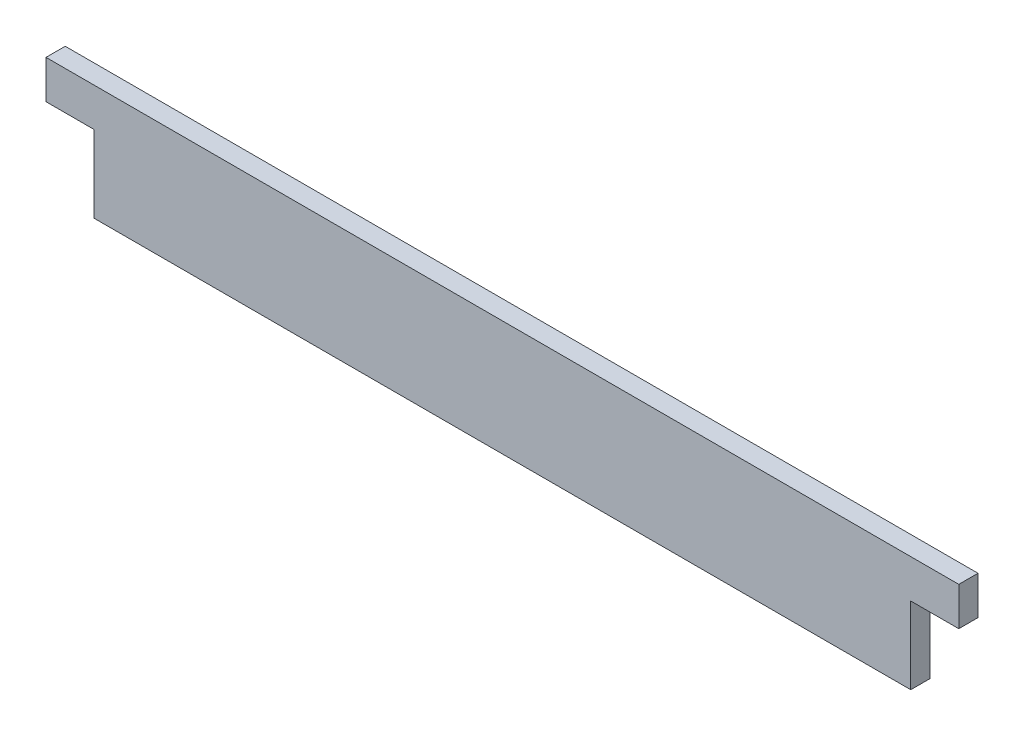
ISO-10303-21;
HEADER;
FILE_DESCRIPTION(('STEP AP214'),'2;1');
FILE_NAME('part.step','',(''),(''),'','','');
FILE_SCHEMA(('AUTOMOTIVE_DESIGN { 1 0 10303 214 1 1 1 1 }'));
ENDSEC;
DATA;
#1=APPLICATION_CONTEXT('core data for automotive mechanical design processes');
#2=APPLICATION_PROTOCOL_DEFINITION('international standard','automotive_design',2000,#1);
#3=PRODUCT_CONTEXT('',#1,'mechanical');
#4=PRODUCT('Part','Part','',(#3));
#5=PRODUCT_RELATED_PRODUCT_CATEGORY('part','',(#4));
#6=PRODUCT_DEFINITION_FORMATION('','',#4);
#7=PRODUCT_DEFINITION_CONTEXT('part definition',#1,'design');
#8=PRODUCT_DEFINITION('design','',#6,#7);
#9=PRODUCT_DEFINITION_SHAPE('','',#8);
#10=(LENGTH_UNIT() NAMED_UNIT(*) SI_UNIT(.MILLI.,.METRE.));
#11=(NAMED_UNIT(*) PLANE_ANGLE_UNIT() SI_UNIT($,.RADIAN.));
#12=(NAMED_UNIT(*) SI_UNIT($,.STERADIAN.) SOLID_ANGLE_UNIT());
#13=UNCERTAINTY_MEASURE_WITH_UNIT(LENGTH_MEASURE(1.E-05),#10,'distance_accuracy_value','');
#14=(GEOMETRIC_REPRESENTATION_CONTEXT(3) GLOBAL_UNCERTAINTY_ASSIGNED_CONTEXT((#13)) GLOBAL_UNIT_ASSIGNED_CONTEXT((#10,
#11,#12)) REPRESENTATION_CONTEXT('',''));
#15=CARTESIAN_POINT('',(0.,0.,0.));
#16=DIRECTION('',(0.,0.,1.));
#17=DIRECTION('',(1.,0.,0.));
#18=AXIS2_PLACEMENT_3D('',#15,#16,#17);
#19=CARTESIAN_POINT('',(-425.,80.,20.));
#20=DIRECTION('',(1.,0.,0.));
#21=DIRECTION('',(0.,0.,-1.));
#22=AXIS2_PLACEMENT_3D('',#19,#20,#21);
#23=PLANE('',#22);
#24=DIRECTION('',(0.,-1.,0.));
#25=VECTOR('',#24,1.);
#26=CARTESIAN_POINT('',(-425.,80.,0.));
#27=LINE('',#26,#25);
#28=CARTESIAN_POINT('',(-425.,80.,0.));
#29=VERTEX_POINT('',#28);
#30=CARTESIAN_POINT('',(-425.,0.,0.));
#31=VERTEX_POINT('',#30);
#32=EDGE_CURVE('E98',#29,#31,#27,.T.);
#33=ORIENTED_EDGE('',*,*,#32,.T.);
#34=DIRECTION('',(0.,0.,-1.));
#35=VECTOR('',#34,1.);
#36=CARTESIAN_POINT('',(-425.,0.,20.));
#37=LINE('',#36,#35);
#38=CARTESIAN_POINT('',(-425.,0.,20.));
#39=VERTEX_POINT('',#38);
#40=EDGE_CURVE('E11',#39,#31,#37,.T.);
#41=ORIENTED_EDGE('',*,*,#40,.F.);
#42=DIRECTION('',(0.,-1.,0.));
#43=VECTOR('',#42,1.);
#44=CARTESIAN_POINT('',(-425.,80.,20.));
#45=LINE('',#44,#43);
#46=CARTESIAN_POINT('',(-425.,80.,20.));
#47=VERTEX_POINT('',#46);
#48=EDGE_CURVE('E125',#47,#39,#45,.T.);
#49=ORIENTED_EDGE('',*,*,#48,.F.);
#50=DIRECTION('',(0.,0.,-1.));
#51=VECTOR('',#50,1.);
#52=CARTESIAN_POINT('',(-425.,80.,20.));
#53=LINE('',#52,#51);
#54=EDGE_CURVE('E111',#47,#29,#53,.T.);
#55=ORIENTED_EDGE('',*,*,#54,.T.);
#56=EDGE_LOOP('',(#33,#41,#49,#55));
#57=FACE_BOUND('',#56,.T.);
#58=ADVANCED_FACE('F30',(#57),#23,.F.);
#59=CARTESIAN_POINT('',(-425.,0.,20.));
#60=DIRECTION('',(0.,1.,0.));
#61=DIRECTION('',(0.,0.,1.));
#62=AXIS2_PLACEMENT_3D('',#59,#60,#61);
#63=PLANE('',#62);
#64=DIRECTION('',(1.,0.,0.));
#65=VECTOR('',#64,1.);
#66=CARTESIAN_POINT('',(-425.,0.,0.));
#67=LINE('',#66,#65);
#68=CARTESIAN_POINT('',(425.,0.,0.));
#69=VERTEX_POINT('',#68);
#70=EDGE_CURVE('E94',#31,#69,#67,.T.);
#71=ORIENTED_EDGE('',*,*,#70,.T.);
#72=DIRECTION('',(0.,0.,-1.));
#73=VECTOR('',#72,1.);
#74=CARTESIAN_POINT('',(425.,0.,20.));
#75=LINE('',#74,#73);
#76=CARTESIAN_POINT('',(425.,0.,20.));
#77=VERTEX_POINT('',#76);
#78=EDGE_CURVE('E37',#77,#69,#75,.T.);
#79=ORIENTED_EDGE('',*,*,#78,.F.);
#80=DIRECTION('',(1.,0.,0.));
#81=VECTOR('',#80,1.);
#82=CARTESIAN_POINT('',(-425.,0.,20.));
#83=LINE('',#82,#81);
#84=EDGE_CURVE('E107',#39,#77,#83,.T.);
#85=ORIENTED_EDGE('',*,*,#84,.F.);
#86=ORIENTED_EDGE('',*,*,#40,.T.);
#87=EDGE_LOOP('',(#71,#79,#85,#86));
#88=FACE_BOUND('',#87,.T.);
#89=ADVANCED_FACE('F106',(#88),#63,.F.);
#90=CARTESIAN_POINT('',(425.,0.,20.));
#91=DIRECTION('',(-1.,0.,0.));
#92=DIRECTION('',(0.,0.,1.));
#93=AXIS2_PLACEMENT_3D('',#90,#91,#92);
#94=PLANE('',#93);
#95=DIRECTION('',(0.,1.,0.));
#96=VECTOR('',#95,1.);
#97=CARTESIAN_POINT('',(425.,0.,0.));
#98=LINE('',#97,#96);
#99=CARTESIAN_POINT('',(425.,80.,0.));
#100=VERTEX_POINT('',#99);
#101=EDGE_CURVE('E100',#69,#100,#98,.T.);
#102=ORIENTED_EDGE('',*,*,#101,.T.);
#103=DIRECTION('',(0.,0.,-1.));
#104=VECTOR('',#103,1.);
#105=CARTESIAN_POINT('',(425.,80.,20.));
#106=LINE('',#105,#104);
#107=CARTESIAN_POINT('',(425.,80.,20.));
#108=VERTEX_POINT('',#107);
#109=EDGE_CURVE('E151',#108,#100,#106,.T.);
#110=ORIENTED_EDGE('',*,*,#109,.F.);
#111=DIRECTION('',(0.,1.,0.));
#112=VECTOR('',#111,1.);
#113=CARTESIAN_POINT('',(425.,0.,20.));
#114=LINE('',#113,#112);
#115=EDGE_CURVE('E128',#77,#108,#114,.T.);
#116=ORIENTED_EDGE('',*,*,#115,.F.);
#117=ORIENTED_EDGE('',*,*,#78,.T.);
#118=EDGE_LOOP('',(#102,#110,#116,#117));
#119=FACE_BOUND('',#118,.T.);
#120=ADVANCED_FACE('F155',(#119),#94,.F.);
#121=CARTESIAN_POINT('',(425.,80.,20.));
#122=DIRECTION('',(0.,1.,0.));
#123=DIRECTION('',(0.,0.,1.));
#124=AXIS2_PLACEMENT_3D('',#121,#122,#123);
#125=PLANE('',#124);
#126=DIRECTION('',(1.,0.,0.));
#127=VECTOR('',#126,1.);
#128=CARTESIAN_POINT('',(425.,80.,0.));
#129=LINE('',#128,#127);
#130=CARTESIAN_POINT('',(475.,80.,0.));
#131=VERTEX_POINT('',#130);
#132=EDGE_CURVE('E115',#100,#131,#129,.T.);
#133=ORIENTED_EDGE('',*,*,#132,.T.);
#134=DIRECTION('',(0.,0.,-1.));
#135=VECTOR('',#134,1.);
#136=CARTESIAN_POINT('',(475.,80.,20.));
#137=LINE('',#136,#135);
#138=CARTESIAN_POINT('',(475.,80.,20.));
#139=VERTEX_POINT('',#138);
#140=EDGE_CURVE('E148',#139,#131,#137,.T.);
#141=ORIENTED_EDGE('',*,*,#140,.F.);
#142=DIRECTION('',(1.,0.,0.));
#143=VECTOR('',#142,1.);
#144=CARTESIAN_POINT('',(425.,80.,20.));
#145=LINE('',#144,#143);
#146=EDGE_CURVE('E130',#108,#139,#145,.T.);
#147=ORIENTED_EDGE('',*,*,#146,.F.);
#148=ORIENTED_EDGE('',*,*,#109,.T.);
#149=EDGE_LOOP('',(#133,#141,#147,#148));
#150=FACE_BOUND('',#149,.T.);
#151=ADVANCED_FACE('F163',(#150),#125,.F.);
#152=CARTESIAN_POINT('',(475.,80.,20.));
#153=DIRECTION('',(-1.,0.,0.));
#154=DIRECTION('',(0.,0.,1.));
#155=AXIS2_PLACEMENT_3D('',#152,#153,#154);
#156=PLANE('',#155);
#157=DIRECTION('',(0.,1.,0.));
#158=VECTOR('',#157,1.);
#159=CARTESIAN_POINT('',(475.,80.,0.));
#160=LINE('',#159,#158);
#161=CARTESIAN_POINT('',(475.,120.,0.));
#162=VERTEX_POINT('',#161);
#163=EDGE_CURVE('E117',#131,#162,#160,.T.);
#164=ORIENTED_EDGE('',*,*,#163,.T.);
#165=DIRECTION('',(0.,0.,-1.));
#166=VECTOR('',#165,1.);
#167=CARTESIAN_POINT('',(475.,120.,20.));
#168=LINE('',#167,#166);
#169=CARTESIAN_POINT('',(475.,120.,20.));
#170=VERTEX_POINT('',#169);
#171=EDGE_CURVE('E145',#170,#162,#168,.T.);
#172=ORIENTED_EDGE('',*,*,#171,.F.);
#173=DIRECTION('',(0.,1.,0.));
#174=VECTOR('',#173,1.);
#175=CARTESIAN_POINT('',(475.,80.,20.));
#176=LINE('',#175,#174);
#177=EDGE_CURVE('E132',#139,#170,#176,.T.);
#178=ORIENTED_EDGE('',*,*,#177,.F.);
#179=ORIENTED_EDGE('',*,*,#140,.T.);
#180=EDGE_LOOP('',(#164,#172,#178,#179));
#181=FACE_BOUND('',#180,.T.);
#182=ADVANCED_FACE('F166',(#181),#156,.F.);
#183=CARTESIAN_POINT('',(475.,120.,20.));
#184=DIRECTION('',(0.,-1.,0.));
#185=DIRECTION('',(1.,0.,0.));
#186=AXIS2_PLACEMENT_3D('',#183,#184,#185);
#187=PLANE('',#186);
#188=DIRECTION('',(-1.,0.,0.));
#189=VECTOR('',#188,1.);
#190=CARTESIAN_POINT('',(475.,120.,0.));
#191=LINE('',#190,#189);
#192=CARTESIAN_POINT('',(-475.,120.,0.));
#193=VERTEX_POINT('',#192);
#194=EDGE_CURVE('E119',#162,#193,#191,.T.);
#195=ORIENTED_EDGE('',*,*,#194,.T.);
#196=DIRECTION('',(0.,0.,-1.));
#197=VECTOR('',#196,1.);
#198=CARTESIAN_POINT('',(-475.,120.,20.));
#199=LINE('',#198,#197);
#200=CARTESIAN_POINT('',(-475.,120.,20.));
#201=VERTEX_POINT('',#200);
#202=EDGE_CURVE('E142',#201,#193,#199,.T.);
#203=ORIENTED_EDGE('',*,*,#202,.F.);
#204=DIRECTION('',(-1.,0.,0.));
#205=VECTOR('',#204,1.);
#206=CARTESIAN_POINT('',(475.,120.,20.));
#207=LINE('',#206,#205);
#208=EDGE_CURVE('E134',#170,#201,#207,.T.);
#209=ORIENTED_EDGE('',*,*,#208,.F.);
#210=ORIENTED_EDGE('',*,*,#171,.T.);
#211=EDGE_LOOP('',(#195,#203,#209,#210));
#212=FACE_BOUND('',#211,.T.);
#213=ADVANCED_FACE('F171',(#212),#187,.F.);
#214=CARTESIAN_POINT('',(-475.,120.,20.));
#215=DIRECTION('',(1.,0.,0.));
#216=DIRECTION('',(0.,0.,-1.));
#217=AXIS2_PLACEMENT_3D('',#214,#215,#216);
#218=PLANE('',#217);
#219=DIRECTION('',(0.,-1.,0.));
#220=VECTOR('',#219,1.);
#221=CARTESIAN_POINT('',(-475.,120.,0.));
#222=LINE('',#221,#220);
#223=CARTESIAN_POINT('',(-475.,80.,0.));
#224=VERTEX_POINT('',#223);
#225=EDGE_CURVE('E121',#193,#224,#222,.T.);
#226=ORIENTED_EDGE('',*,*,#225,.T.);
#227=DIRECTION('',(0.,0.,-1.));
#228=VECTOR('',#227,1.);
#229=CARTESIAN_POINT('',(-475.,80.,20.));
#230=LINE('',#229,#228);
#231=CARTESIAN_POINT('',(-475.,80.,20.));
#232=VERTEX_POINT('',#231);
#233=EDGE_CURVE('E139',#232,#224,#230,.T.);
#234=ORIENTED_EDGE('',*,*,#233,.F.);
#235=DIRECTION('',(0.,-1.,0.));
#236=VECTOR('',#235,1.);
#237=CARTESIAN_POINT('',(-475.,120.,20.));
#238=LINE('',#237,#236);
#239=EDGE_CURVE('E49',#201,#232,#238,.T.);
#240=ORIENTED_EDGE('',*,*,#239,.F.);
#241=ORIENTED_EDGE('',*,*,#202,.T.);
#242=EDGE_LOOP('',(#226,#234,#240,#241));
#243=FACE_BOUND('',#242,.T.);
#244=ADVANCED_FACE('F174',(#243),#218,.F.);
#245=CARTESIAN_POINT('',(-475.,80.,20.));
#246=DIRECTION('',(0.,1.,0.));
#247=DIRECTION('',(-1.,0.,0.));
#248=AXIS2_PLACEMENT_3D('',#245,#246,#247);
#249=PLANE('',#248);
#250=DIRECTION('',(1.,0.,0.));
#251=VECTOR('',#250,1.);
#252=CARTESIAN_POINT('',(-475.,80.,0.));
#253=LINE('',#252,#251);
#254=EDGE_CURVE('E123',#224,#29,#253,.T.);
#255=ORIENTED_EDGE('',*,*,#254,.T.);
#256=ORIENTED_EDGE('',*,*,#54,.F.);
#257=DIRECTION('',(1.,0.,0.));
#258=VECTOR('',#257,1.);
#259=CARTESIAN_POINT('',(-475.,80.,20.));
#260=LINE('',#259,#258);
#261=EDGE_CURVE('E44',#232,#47,#260,.T.);
#262=ORIENTED_EDGE('',*,*,#261,.F.);
#263=ORIENTED_EDGE('',*,*,#233,.T.);
#264=EDGE_LOOP('',(#255,#256,#262,#263));
#265=FACE_BOUND('',#264,.T.);
#266=ADVANCED_FACE('F176',(#265),#249,.F.);
#267=CARTESIAN_POINT('',(-425.,0.,20.));
#268=DIRECTION('',(0.,0.,1.));
#269=DIRECTION('',(1.,0.,0.));
#270=AXIS2_PLACEMENT_3D('',#267,#268,#269);
#271=PLANE('',#270);
#272=ORIENTED_EDGE('',*,*,#48,.T.);
#273=ORIENTED_EDGE('',*,*,#84,.T.);
#274=ORIENTED_EDGE('',*,*,#115,.T.);
#275=ORIENTED_EDGE('',*,*,#146,.T.);
#276=ORIENTED_EDGE('',*,*,#177,.T.);
#277=ORIENTED_EDGE('',*,*,#208,.T.);
#278=ORIENTED_EDGE('',*,*,#239,.T.);
#279=ORIENTED_EDGE('',*,*,#261,.T.);
#280=EDGE_LOOP('',(#272,#273,#274,#275,#276,#277,#278,#279));
#281=FACE_BOUND('',#280,.T.);
#282=ADVANCED_FACE('F158',(#281),#271,.T.);
#283=CARTESIAN_POINT('',(-425.,0.,0.));
#284=DIRECTION('',(0.,0.,1.));
#285=DIRECTION('',(1.,0.,0.));
#286=AXIS2_PLACEMENT_3D('',#283,#284,#285);
#287=PLANE('',#286);
#288=ORIENTED_EDGE('',*,*,#32,.F.);
#289=ORIENTED_EDGE('',*,*,#254,.F.);
#290=ORIENTED_EDGE('',*,*,#225,.F.);
#291=ORIENTED_EDGE('',*,*,#194,.F.);
#292=ORIENTED_EDGE('',*,*,#163,.F.);
#293=ORIENTED_EDGE('',*,*,#132,.F.);
#294=ORIENTED_EDGE('',*,*,#101,.F.);
#295=ORIENTED_EDGE('',*,*,#70,.F.);
#296=EDGE_LOOP('',(#288,#289,#290,#291,#292,#293,#294,#295));
#297=FACE_BOUND('',#296,.T.);
#298=ADVANCED_FACE('F95',(#297),#287,.F.);
#299=CLOSED_SHELL('',(#58,#89,#120,#151,#182,#213,#244,#266,#282,#298));
#300=MANIFOLD_SOLID_BREP('B2',#299);
#301=ADVANCED_BREP_SHAPE_REPRESENTATION('',(#18,#300),#14);
#302=SHAPE_DEFINITION_REPRESENTATION(#9,#301);
ENDSEC;
END-ISO-10303-21;
